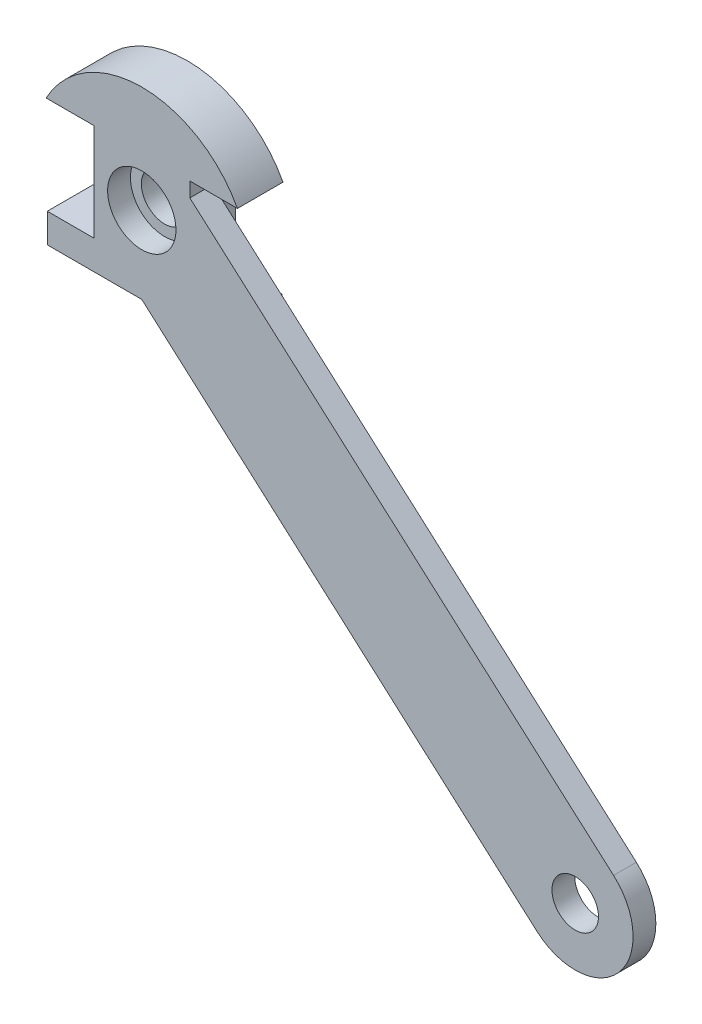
from build123d import *

# Parameters (mm, degrees)
BOSS_EXTRUDE2_DEPTH     = 10
CUT_EXTRUDE2_DEPTH      = 32.853215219
CUT_EXTRUDE2_DEPTH_BACK = 32.853215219
SKETCH4_R               = 5.1
BOSS_EXTRUDE3_DEPTH     = 5
SKETCH6_R               = 5
CUT_EXTRUDE3_DEPTH      = 146.017382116
SKETCH7_R               = 5.1
CUT_EXTRUDE4_DEPTH      = 146.017382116
SKETCH8_R               = 7.5
CUT_EXTRUDE5_DEPTH      = 5


with BuildPart() as part:
    # Sketch3 → Boss-Extrude2 (new body)
    with BuildSketch(Plane.XY):
        with BuildLine():
            Line((-20.74, -16.94245), (20.74, -16.94245))
            Line((20.74, -16.94245), (20.74, -10.5429))
            Line((20.74, -10.5429), (10.54169, -10.5429))
            Line((10.54169, -10.5429), (10.54169, 10.84581))
            Line((10.54169, 10.84581), (20.99169, 10.84581))
            ThreePointArc((20.99169, 10.84581), (0, 23.430242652), (-20.99169, 10.84581))
            Line((-20.99169, 10.84581), (-10.54169, 10.84581))
            Line((-10.54169, 10.84581), (-10.54169, -10.5429))
            Line((-10.54169, -10.5429), (-20.74, -10.5429))
            Line((-20.74, -10.5429), (-20.74, -16.94245))
        make_face()
    extrude(amount=BOSS_EXTRUDE2_DEPTH)

    # Sketch4 → Cut-Extrude2 (cut, two sides: drawn at the far end of the back side and taken through both)
    with BuildSketch(Plane.XY.offset(5).offset(-CUT_EXTRUDE2_DEPTH_BACK)):
        Circle(SKETCH4_R)
    extrude(amount=CUT_EXTRUDE2_DEPTH + CUT_EXTRUDE2_DEPTH_BACK, mode=Mode.SUBTRACT)

    # Sketch5 → Boss-Extrude3 (add)
    with BuildSketch(Plane.XY.offset(5)):
        with BuildLine():
            Line((8.858299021, 9.119782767), (103.532651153, -74.641008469))
            ThreePointArc((103.532651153, -74.641008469), (104.629114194, -92.568020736), (86.702101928, -93.664483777))
            Line((86.702101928, -93.664483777), (-7.972250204, -9.903692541))
            ThreePointArc((-7.972250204, -9.903692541), (-6.922429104, 6.12444792), (8.858299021, 9.119782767))
        make_face()
    extrude(amount=BOSS_EXTRUDE3_DEPTH)

    # Sketch6 → Cut-Extrude3 (cut, through all)
    with BuildSketch(Plane.XY.offset(5)):
        Circle(SKETCH6_R)
    extrude(amount=CUT_EXTRUDE3_DEPTH, mode=Mode.SUBTRACT)

    # Sketch7 → Cut-Extrude4 (cut, through all)
    with BuildSketch(Plane.XY.offset(5)):
        with Locations((95.11737654, -84.152746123)):
            Circle(SKETCH7_R)
    extrude(amount=CUT_EXTRUDE4_DEPTH, mode=Mode.SUBTRACT)

    # Sketch8 → Cut-Extrude5 (cut)
    with BuildSketch(Plane.XY.offset(5)):
        Circle(SKETCH8_R)
    extrude(amount=CUT_EXTRUDE5_DEPTH, mode=Mode.SUBTRACT)


solid = part.part
